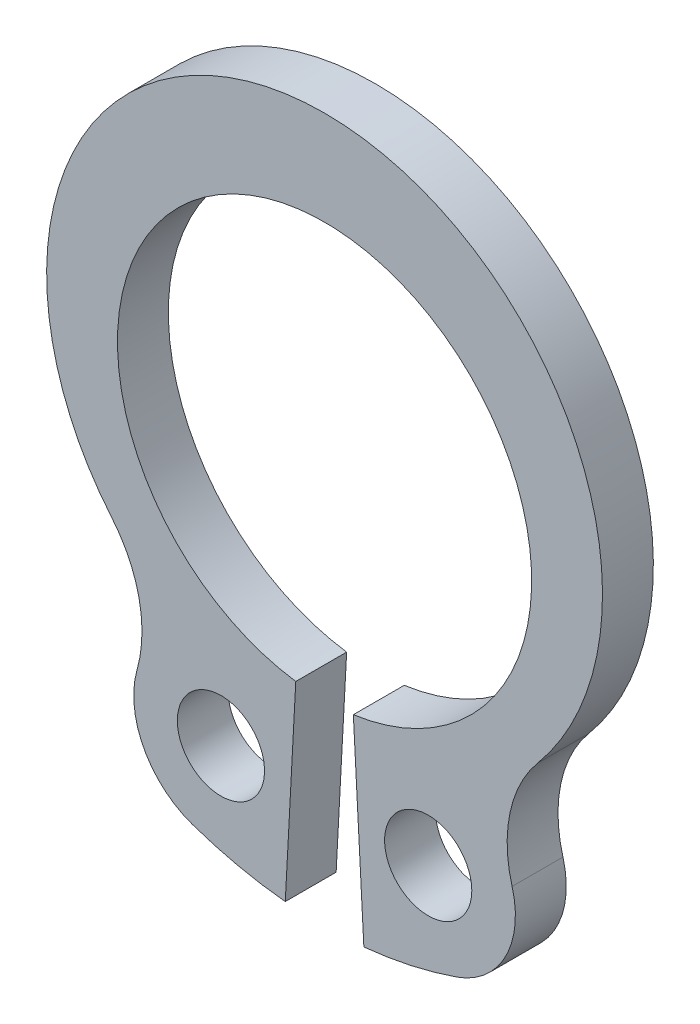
ISO-10303-21;
HEADER;
FILE_DESCRIPTION(('STEP AP214'),'2;1');
FILE_NAME('part.step','',(''),(''),'','','');
FILE_SCHEMA(('AUTOMOTIVE_DESIGN { 1 0 10303 214 1 1 1 1 }'));
ENDSEC;
DATA;
#1=APPLICATION_CONTEXT('core data for automotive mechanical design processes');
#2=APPLICATION_PROTOCOL_DEFINITION('international standard','automotive_design',2000,#1);
#3=PRODUCT_CONTEXT('',#1,'mechanical');
#4=PRODUCT('Part','Part','',(#3));
#5=PRODUCT_RELATED_PRODUCT_CATEGORY('part','',(#4));
#6=PRODUCT_DEFINITION_FORMATION('','',#4);
#7=PRODUCT_DEFINITION_CONTEXT('part definition',#1,'design');
#8=PRODUCT_DEFINITION('design','',#6,#7);
#9=PRODUCT_DEFINITION_SHAPE('','',#8);
#10=(LENGTH_UNIT() NAMED_UNIT(*) SI_UNIT(.MILLI.,.METRE.));
#11=(NAMED_UNIT(*) PLANE_ANGLE_UNIT() SI_UNIT($,.RADIAN.));
#12=(NAMED_UNIT(*) SI_UNIT($,.STERADIAN.) SOLID_ANGLE_UNIT());
#13=UNCERTAINTY_MEASURE_WITH_UNIT(LENGTH_MEASURE(1.E-05),#10,'distance_accuracy_value','');
#14=(GEOMETRIC_REPRESENTATION_CONTEXT(3) GLOBAL_UNCERTAINTY_ASSIGNED_CONTEXT((#13)) GLOBAL_UNIT_ASSIGNED_CONTEXT((#10,
#11,#12)) REPRESENTATION_CONTEXT('',''));
#15=CARTESIAN_POINT('',(0.,0.,0.));
#16=DIRECTION('',(0.,0.,1.));
#17=DIRECTION('',(1.,0.,0.));
#18=AXIS2_PLACEMENT_3D('',#15,#16,#17);
#19=CARTESIAN_POINT('',(0.,0.,0.7));
#20=DIRECTION('',(0.,0.,1.));
#21=DIRECTION('',(1.,0.,0.));
#22=AXIS2_PLACEMENT_3D('',#19,#20,#21);
#23=PLANE('',#22);
#24=CARTESIAN_POINT('',(-1.42625225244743,-4.10413419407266,0.7));
#25=DIRECTION('',(0.,0.,1.));
#26=DIRECTION('',(-1.,0.,0.));
#27=AXIS2_PLACEMENT_3D('',#24,#25,#26);
#28=CIRCLE('',#27,0.6);
#29=CARTESIAN_POINT('',(-2.02625225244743,-4.10413419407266,0.7));
#30=VERTEX_POINT('',#29);
#31=EDGE_CURVE('E120',#30,#30,#28,.T.);
#32=ORIENTED_EDGE('',*,*,#31,.F.);
#33=EDGE_LOOP('',(#32));
#34=FACE_BOUND('',#33,.T.);
#35=CARTESIAN_POINT('',(0.,0.,0.7));
#36=DIRECTION('',(0.,0.,-1.));
#37=DIRECTION('',(1.,0.,0.));
#38=AXIS2_PLACEMENT_3D('',#35,#36,#37);
#39=CIRCLE('',#38,2.85);
#40=CARTESIAN_POINT('',(-0.396088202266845,-2.82234195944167,0.7));
#41=VERTEX_POINT('',#40);
#42=CARTESIAN_POINT('',(0.396088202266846,-2.82234195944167,0.7));
#43=VERTEX_POINT('',#42);
#44=EDGE_CURVE('E142',#41,#43,#39,.T.);
#45=ORIENTED_EDGE('',*,*,#44,.T.);
#46=DIRECTION('',(0.0535843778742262,-0.998563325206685,0.));
#47=VECTOR('',#46,1.);
#48=CARTESIAN_POINT('',(0.396088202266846,-2.82234195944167,0.7));
#49=LINE('',#48,#47);
#50=CARTESIAN_POINT('',(0.540766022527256,-5.51846293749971,0.7));
#51=VERTEX_POINT('',#50);
#52=EDGE_CURVE('E115',#43,#51,#49,.T.);
#53=ORIENTED_EDGE('',*,*,#52,.T.);
#54=CARTESIAN_POINT('',(0.,0.,0.7));
#55=DIRECTION('',(0.,0.,1.));
#56=DIRECTION('',(1.,0.,0.));
#57=AXIS2_PLACEMENT_3D('',#54,#55,#56);
#58=CIRCLE('',#57,5.5448950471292);
#59=CARTESIAN_POINT('',(1.82016342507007,-5.23763937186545,0.7));
#60=VERTEX_POINT('',#59);
#61=EDGE_CURVE('E145',#51,#60,#58,.T.);
#62=ORIENTED_EDGE('',*,*,#61,.T.);
#63=CARTESIAN_POINT('',(1.42625225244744,-4.10413419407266,0.7));
#64=DIRECTION('',(0.,0.,1.));
#65=DIRECTION('',(1.,0.,0.));
#66=AXIS2_PLACEMENT_3D('',#63,#64,#65);
#67=CIRCLE('',#66,1.2);
#68=CARTESIAN_POINT('',(2.58080605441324,-3.77701721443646,0.7));
#69=VERTEX_POINT('',#68);
#70=EDGE_CURVE('E147',#60,#69,#67,.T.);
#71=ORIENTED_EDGE('',*,*,#70,.T.);
#72=CARTESIAN_POINT('',(4.31263675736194,-3.28634174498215,0.7));
#73=DIRECTION('',(0.,0.,-1.));
#74=DIRECTION('',(1.,0.,0.));
#75=AXIS2_PLACEMENT_3D('',#72,#73,#74);
#76=CIRCLE('',#75,1.8);
#77=CARTESIAN_POINT('',(2.93259299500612,-2.13071238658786,0.7));
#78=VERTEX_POINT('',#77);
#79=EDGE_CURVE('E149',#69,#78,#76,.T.);
#80=ORIENTED_EDGE('',*,*,#79,.T.);
#81=CARTESIAN_POINT('',(0.,0.325,0.7));
#82=DIRECTION('',(0.,0.,1.));
#83=DIRECTION('',(1.,0.,0.));
#84=AXIS2_PLACEMENT_3D('',#81,#82,#83);
#85=CIRCLE('',#84,3.825);
#86=CARTESIAN_POINT('',(-2.93259299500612,-2.13071238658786,0.7));
#87=VERTEX_POINT('',#86);
#88=EDGE_CURVE('E151',#78,#87,#85,.T.);
#89=ORIENTED_EDGE('',*,*,#88,.T.);
#90=CARTESIAN_POINT('',(-4.31263675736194,-3.28634174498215,0.7));
#91=DIRECTION('',(0.,0.,-1.));
#92=DIRECTION('',(-1.,0.,0.));
#93=AXIS2_PLACEMENT_3D('',#90,#91,#92);
#94=CIRCLE('',#93,1.8);
#95=CARTESIAN_POINT('',(-2.58080605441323,-3.77701721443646,0.7));
#96=VERTEX_POINT('',#95);
#97=EDGE_CURVE('E153',#87,#96,#94,.T.);
#98=ORIENTED_EDGE('',*,*,#97,.T.);
#99=CARTESIAN_POINT('',(-1.42625225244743,-4.10413419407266,0.7));
#100=DIRECTION('',(0.,0.,1.));
#101=DIRECTION('',(-1.,0.,0.));
#102=AXIS2_PLACEMENT_3D('',#99,#100,#101);
#103=CIRCLE('',#102,1.2);
#104=CARTESIAN_POINT('',(-1.82016342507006,-5.23763937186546,0.7));
#105=VERTEX_POINT('',#104);
#106=EDGE_CURVE('E155',#96,#105,#103,.T.);
#107=ORIENTED_EDGE('',*,*,#106,.T.);
#108=CARTESIAN_POINT('',(0.,0.,0.7));
#109=DIRECTION('',(0.,0.,1.));
#110=DIRECTION('',(-1.,0.,0.));
#111=AXIS2_PLACEMENT_3D('',#108,#109,#110);
#112=CIRCLE('',#111,5.5448950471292);
#113=CARTESIAN_POINT('',(-0.540766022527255,-5.51846293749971,0.7));
#114=VERTEX_POINT('',#113);
#115=EDGE_CURVE('E44',#105,#114,#112,.T.);
#116=ORIENTED_EDGE('',*,*,#115,.T.);
#117=DIRECTION('',(0.053584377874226,0.998563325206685,0.));
#118=VECTOR('',#117,1.);
#119=CARTESIAN_POINT('',(-0.396088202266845,-2.82234195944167,0.7));
#120=LINE('',#119,#118);
#121=EDGE_CURVE('E39',#114,#41,#120,.T.);
#122=ORIENTED_EDGE('',*,*,#121,.T.);
#123=EDGE_LOOP('',(#45,#53,#62,#71,#80,#89,#98,#107,#116,#122));
#124=FACE_BOUND('',#123,.T.);
#125=CARTESIAN_POINT('',(1.42625225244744,-4.10413419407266,0.7));
#126=DIRECTION('',(0.,0.,1.));
#127=DIRECTION('',(1.,0.,0.));
#128=AXIS2_PLACEMENT_3D('',#125,#126,#127);
#129=CIRCLE('',#128,0.6);
#130=CARTESIAN_POINT('',(2.02625225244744,-4.10413419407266,0.7));
#131=VERTEX_POINT('',#130);
#132=EDGE_CURVE('E242',#131,#131,#129,.T.);
#133=ORIENTED_EDGE('',*,*,#132,.F.);
#134=EDGE_LOOP('',(#133));
#135=FACE_BOUND('',#134,.T.);
#136=ADVANCED_FACE('F24',(#34,#124,#135),#23,.T.);
#137=CARTESIAN_POINT('',(0.,0.,0.));
#138=DIRECTION('',(0.,0.,1.));
#139=DIRECTION('',(1.,0.,0.));
#140=AXIS2_PLACEMENT_3D('',#137,#138,#139);
#141=PLANE('',#140);
#142=CARTESIAN_POINT('',(-1.42625225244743,-4.10413419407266,0.));
#143=DIRECTION('',(0.,0.,1.));
#144=DIRECTION('',(-1.,0.,0.));
#145=AXIS2_PLACEMENT_3D('',#142,#143,#144);
#146=CIRCLE('',#145,0.6);
#147=CARTESIAN_POINT('',(-2.02625225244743,-4.10413419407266,0.));
#148=VERTEX_POINT('',#147);
#149=EDGE_CURVE('E123',#148,#148,#146,.T.);
#150=ORIENTED_EDGE('',*,*,#149,.T.);
#151=EDGE_LOOP('',(#150));
#152=FACE_BOUND('',#151,.T.);
#153=CARTESIAN_POINT('',(0.,0.,0.));
#154=DIRECTION('',(0.,0.,-1.));
#155=DIRECTION('',(1.,0.,0.));
#156=AXIS2_PLACEMENT_3D('',#153,#154,#155);
#157=CIRCLE('',#156,2.85);
#158=CARTESIAN_POINT('',(-0.396088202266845,-2.82234195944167,0.));
#159=VERTEX_POINT('',#158);
#160=CARTESIAN_POINT('',(0.396088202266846,-2.82234195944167,0.));
#161=VERTEX_POINT('',#160);
#162=EDGE_CURVE('E106',#159,#161,#157,.T.);
#163=ORIENTED_EDGE('',*,*,#162,.F.);
#164=DIRECTION('',(0.053584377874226,0.998563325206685,0.));
#165=VECTOR('',#164,1.);
#166=CARTESIAN_POINT('',(-0.396088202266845,-2.82234195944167,0.));
#167=LINE('',#166,#165);
#168=CARTESIAN_POINT('',(-0.540766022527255,-5.51846293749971,0.));
#169=VERTEX_POINT('',#168);
#170=EDGE_CURVE('E140',#169,#159,#167,.T.);
#171=ORIENTED_EDGE('',*,*,#170,.F.);
#172=CARTESIAN_POINT('',(0.,0.,0.));
#173=DIRECTION('',(0.,0.,1.));
#174=DIRECTION('',(-1.,0.,0.));
#175=AXIS2_PLACEMENT_3D('',#172,#173,#174);
#176=CIRCLE('',#175,5.5448950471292);
#177=CARTESIAN_POINT('',(-1.82016342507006,-5.23763937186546,0.));
#178=VERTEX_POINT('',#177);
#179=EDGE_CURVE('E138',#178,#169,#176,.T.);
#180=ORIENTED_EDGE('',*,*,#179,.F.);
#181=CARTESIAN_POINT('',(-1.42625225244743,-4.10413419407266,0.));
#182=DIRECTION('',(0.,0.,1.));
#183=DIRECTION('',(-1.,0.,0.));
#184=AXIS2_PLACEMENT_3D('',#181,#182,#183);
#185=CIRCLE('',#184,1.2);
#186=CARTESIAN_POINT('',(-2.58080605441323,-3.77701721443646,0.));
#187=VERTEX_POINT('',#186);
#188=EDGE_CURVE('E136',#187,#178,#185,.T.);
#189=ORIENTED_EDGE('',*,*,#188,.F.);
#190=CARTESIAN_POINT('',(-4.31263675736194,-3.28634174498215,0.));
#191=DIRECTION('',(0.,0.,-1.));
#192=DIRECTION('',(-1.,0.,0.));
#193=AXIS2_PLACEMENT_3D('',#190,#191,#192);
#194=CIRCLE('',#193,1.8);
#195=CARTESIAN_POINT('',(-2.93259299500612,-2.13071238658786,0.));
#196=VERTEX_POINT('',#195);
#197=EDGE_CURVE('E134',#196,#187,#194,.T.);
#198=ORIENTED_EDGE('',*,*,#197,.F.);
#199=CARTESIAN_POINT('',(0.,0.325,0.));
#200=DIRECTION('',(0.,0.,1.));
#201=DIRECTION('',(1.,0.,0.));
#202=AXIS2_PLACEMENT_3D('',#199,#200,#201);
#203=CIRCLE('',#202,3.825);
#204=CARTESIAN_POINT('',(2.93259299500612,-2.13071238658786,0.));
#205=VERTEX_POINT('',#204);
#206=EDGE_CURVE('E132',#205,#196,#203,.T.);
#207=ORIENTED_EDGE('',*,*,#206,.F.);
#208=CARTESIAN_POINT('',(4.31263675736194,-3.28634174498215,0.));
#209=DIRECTION('',(0.,0.,-1.));
#210=DIRECTION('',(1.,0.,0.));
#211=AXIS2_PLACEMENT_3D('',#208,#209,#210);
#212=CIRCLE('',#211,1.8);
#213=CARTESIAN_POINT('',(2.58080605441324,-3.77701721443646,0.));
#214=VERTEX_POINT('',#213);
#215=EDGE_CURVE('E130',#214,#205,#212,.T.);
#216=ORIENTED_EDGE('',*,*,#215,.F.);
#217=CARTESIAN_POINT('',(1.42625225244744,-4.10413419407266,0.));
#218=DIRECTION('',(0.,0.,1.));
#219=DIRECTION('',(1.,0.,0.));
#220=AXIS2_PLACEMENT_3D('',#217,#218,#219);
#221=CIRCLE('',#220,1.2);
#222=CARTESIAN_POINT('',(1.82016342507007,-5.23763937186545,0.));
#223=VERTEX_POINT('',#222);
#224=EDGE_CURVE('E128',#223,#214,#221,.T.);
#225=ORIENTED_EDGE('',*,*,#224,.F.);
#226=CARTESIAN_POINT('',(0.,0.,0.));
#227=DIRECTION('',(0.,0.,1.));
#228=DIRECTION('',(1.,0.,0.));
#229=AXIS2_PLACEMENT_3D('',#226,#227,#228);
#230=CIRCLE('',#229,5.5448950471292);
#231=CARTESIAN_POINT('',(0.540766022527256,-5.51846293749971,0.));
#232=VERTEX_POINT('',#231);
#233=EDGE_CURVE('E108',#232,#223,#230,.T.);
#234=ORIENTED_EDGE('',*,*,#233,.F.);
#235=DIRECTION('',(0.0535843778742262,-0.998563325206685,0.));
#236=VECTOR('',#235,1.);
#237=CARTESIAN_POINT('',(0.396088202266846,-2.82234195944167,0.));
#238=LINE('',#237,#236);
#239=EDGE_CURVE('E101',#161,#232,#238,.T.);
#240=ORIENTED_EDGE('',*,*,#239,.F.);
#241=EDGE_LOOP('',(#163,#171,#180,#189,#198,#207,#216,#225,#234,#240));
#242=FACE_BOUND('',#241,.T.);
#243=CARTESIAN_POINT('',(1.42625225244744,-4.10413419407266,0.));
#244=DIRECTION('',(0.,0.,1.));
#245=DIRECTION('',(1.,0.,0.));
#246=AXIS2_PLACEMENT_3D('',#243,#244,#245);
#247=CIRCLE('',#246,0.6);
#248=CARTESIAN_POINT('',(2.02625225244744,-4.10413419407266,0.));
#249=VERTEX_POINT('',#248);
#250=EDGE_CURVE('E245',#249,#249,#247,.T.);
#251=ORIENTED_EDGE('',*,*,#250,.T.);
#252=EDGE_LOOP('',(#251));
#253=FACE_BOUND('',#252,.T.);
#254=ADVANCED_FACE('F102',(#152,#242,#253),#141,.F.);
#255=CARTESIAN_POINT('',(0.,0.,0.7));
#256=DIRECTION('',(0.,0.,-1.));
#257=DIRECTION('',(-1.,0.,0.));
#258=AXIS2_PLACEMENT_3D('',#255,#256,#257);
#259=CYLINDRICAL_SURFACE('',#258,2.85);
#260=ORIENTED_EDGE('',*,*,#162,.T.);
#261=DIRECTION('',(0.,0.,-1.));
#262=VECTOR('',#261,1.);
#263=CARTESIAN_POINT('',(0.396088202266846,-2.82234195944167,0.7));
#264=LINE('',#263,#262);
#265=EDGE_CURVE('E11',#43,#161,#264,.T.);
#266=ORIENTED_EDGE('',*,*,#265,.F.);
#267=ORIENTED_EDGE('',*,*,#44,.F.);
#268=DIRECTION('',(0.,0.,-1.));
#269=VECTOR('',#268,1.);
#270=CARTESIAN_POINT('',(-0.396088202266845,-2.82234195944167,0.7));
#271=LINE('',#270,#269);
#272=EDGE_CURVE('E119',#41,#159,#271,.T.);
#273=ORIENTED_EDGE('',*,*,#272,.T.);
#274=EDGE_LOOP('',(#260,#266,#267,#273));
#275=FACE_BOUND('',#274,.T.);
#276=ADVANCED_FACE('F26',(#275),#259,.F.);
#277=CARTESIAN_POINT('',(0.396088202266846,-2.82234195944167,0.7));
#278=DIRECTION('',(0.998563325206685,0.0535843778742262,0.));
#279=DIRECTION('',(-0.0535843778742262,0.998563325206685,0.));
#280=AXIS2_PLACEMENT_3D('',#277,#278,#279);
#281=PLANE('',#280);
#282=ORIENTED_EDGE('',*,*,#239,.T.);
#283=DIRECTION('',(0.,0.,-1.));
#284=VECTOR('',#283,1.);
#285=CARTESIAN_POINT('',(0.540766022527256,-5.51846293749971,0.7));
#286=LINE('',#285,#284);
#287=EDGE_CURVE('E32',#51,#232,#286,.T.);
#288=ORIENTED_EDGE('',*,*,#287,.F.);
#289=ORIENTED_EDGE('',*,*,#52,.F.);
#290=ORIENTED_EDGE('',*,*,#265,.T.);
#291=EDGE_LOOP('',(#282,#288,#289,#290));
#292=FACE_BOUND('',#291,.T.);
#293=ADVANCED_FACE('F114',(#292),#281,.F.);
#294=CARTESIAN_POINT('',(0.,0.,0.7));
#295=DIRECTION('',(0.,0.,-1.));
#296=DIRECTION('',(-1.,0.,0.));
#297=AXIS2_PLACEMENT_3D('',#294,#295,#296);
#298=CYLINDRICAL_SURFACE('',#297,5.5448950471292);
#299=ORIENTED_EDGE('',*,*,#233,.T.);
#300=DIRECTION('',(0.,0.,-1.));
#301=VECTOR('',#300,1.);
#302=CARTESIAN_POINT('',(1.82016342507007,-5.23763937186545,0.7));
#303=LINE('',#302,#301);
#304=EDGE_CURVE('E178',#60,#223,#303,.T.);
#305=ORIENTED_EDGE('',*,*,#304,.F.);
#306=ORIENTED_EDGE('',*,*,#61,.F.);
#307=ORIENTED_EDGE('',*,*,#287,.T.);
#308=EDGE_LOOP('',(#299,#305,#306,#307));
#309=FACE_BOUND('',#308,.T.);
#310=ADVANCED_FACE('F182',(#309),#298,.T.);
#311=CARTESIAN_POINT('',(1.42625225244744,-4.10413419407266,0.7));
#312=DIRECTION('',(0.,0.,-1.));
#313=DIRECTION('',(-1.,0.,0.));
#314=AXIS2_PLACEMENT_3D('',#311,#312,#313);
#315=CYLINDRICAL_SURFACE('',#314,1.2);
#316=ORIENTED_EDGE('',*,*,#224,.T.);
#317=DIRECTION('',(0.,0.,-1.));
#318=VECTOR('',#317,1.);
#319=CARTESIAN_POINT('',(2.58080605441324,-3.77701721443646,0.7));
#320=LINE('',#319,#318);
#321=EDGE_CURVE('E175',#69,#214,#320,.T.);
#322=ORIENTED_EDGE('',*,*,#321,.F.);
#323=ORIENTED_EDGE('',*,*,#70,.F.);
#324=ORIENTED_EDGE('',*,*,#304,.T.);
#325=EDGE_LOOP('',(#316,#322,#323,#324));
#326=FACE_BOUND('',#325,.T.);
#327=ADVANCED_FACE('F190',(#326),#315,.T.);
#328=CARTESIAN_POINT('',(4.31263675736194,-3.28634174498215,0.7));
#329=DIRECTION('',(0.,0.,-1.));
#330=DIRECTION('',(-1.,0.,0.));
#331=AXIS2_PLACEMENT_3D('',#328,#329,#330);
#332=CYLINDRICAL_SURFACE('',#331,1.8);
#333=ORIENTED_EDGE('',*,*,#215,.T.);
#334=DIRECTION('',(0.,0.,-1.));
#335=VECTOR('',#334,1.);
#336=CARTESIAN_POINT('',(2.93259299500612,-2.13071238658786,0.7));
#337=LINE('',#336,#335);
#338=EDGE_CURVE('E172',#78,#205,#337,.T.);
#339=ORIENTED_EDGE('',*,*,#338,.F.);
#340=ORIENTED_EDGE('',*,*,#79,.F.);
#341=ORIENTED_EDGE('',*,*,#321,.T.);
#342=EDGE_LOOP('',(#333,#339,#340,#341));
#343=FACE_BOUND('',#342,.T.);
#344=ADVANCED_FACE('F193',(#343),#332,.F.);
#345=CARTESIAN_POINT('',(0.,0.325,0.7));
#346=DIRECTION('',(0.,0.,-1.));
#347=DIRECTION('',(-1.,0.,0.));
#348=AXIS2_PLACEMENT_3D('',#345,#346,#347);
#349=CYLINDRICAL_SURFACE('',#348,3.825);
#350=ORIENTED_EDGE('',*,*,#206,.T.);
#351=DIRECTION('',(0.,0.,-1.));
#352=VECTOR('',#351,1.);
#353=CARTESIAN_POINT('',(-2.93259299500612,-2.13071238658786,0.7));
#354=LINE('',#353,#352);
#355=EDGE_CURVE('E169',#87,#196,#354,.T.);
#356=ORIENTED_EDGE('',*,*,#355,.F.);
#357=ORIENTED_EDGE('',*,*,#88,.F.);
#358=ORIENTED_EDGE('',*,*,#338,.T.);
#359=EDGE_LOOP('',(#350,#356,#357,#358));
#360=FACE_BOUND('',#359,.T.);
#361=ADVANCED_FACE('F198',(#360),#349,.T.);
#362=CARTESIAN_POINT('',(-4.31263675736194,-3.28634174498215,0.7));
#363=DIRECTION('',(0.,0.,-1.));
#364=DIRECTION('',(-1.,0.,0.));
#365=AXIS2_PLACEMENT_3D('',#362,#363,#364);
#366=CYLINDRICAL_SURFACE('',#365,1.8);
#367=ORIENTED_EDGE('',*,*,#197,.T.);
#368=DIRECTION('',(0.,0.,-1.));
#369=VECTOR('',#368,1.);
#370=CARTESIAN_POINT('',(-2.58080605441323,-3.77701721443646,0.7));
#371=LINE('',#370,#369);
#372=EDGE_CURVE('E166',#96,#187,#371,.T.);
#373=ORIENTED_EDGE('',*,*,#372,.F.);
#374=ORIENTED_EDGE('',*,*,#97,.F.);
#375=ORIENTED_EDGE('',*,*,#355,.T.);
#376=EDGE_LOOP('',(#367,#373,#374,#375));
#377=FACE_BOUND('',#376,.T.);
#378=ADVANCED_FACE('F204',(#377),#366,.F.);
#379=CARTESIAN_POINT('',(-1.42625225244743,-4.10413419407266,0.7));
#380=DIRECTION('',(0.,0.,-1.));
#381=DIRECTION('',(-1.,0.,0.));
#382=AXIS2_PLACEMENT_3D('',#379,#380,#381);
#383=CYLINDRICAL_SURFACE('',#382,1.2);
#384=ORIENTED_EDGE('',*,*,#188,.T.);
#385=DIRECTION('',(0.,0.,-1.));
#386=VECTOR('',#385,1.);
#387=CARTESIAN_POINT('',(-1.82016342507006,-5.23763937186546,0.7));
#388=LINE('',#387,#386);
#389=EDGE_CURVE('E163',#105,#178,#388,.T.);
#390=ORIENTED_EDGE('',*,*,#389,.F.);
#391=ORIENTED_EDGE('',*,*,#106,.F.);
#392=ORIENTED_EDGE('',*,*,#372,.T.);
#393=EDGE_LOOP('',(#384,#390,#391,#392));
#394=FACE_BOUND('',#393,.T.);
#395=ADVANCED_FACE('F208',(#394),#383,.T.);
#396=CARTESIAN_POINT('',(0.,0.,0.7));
#397=DIRECTION('',(0.,0.,-1.));
#398=DIRECTION('',(-1.,0.,0.));
#399=AXIS2_PLACEMENT_3D('',#396,#397,#398);
#400=CYLINDRICAL_SURFACE('',#399,5.5448950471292);
#401=ORIENTED_EDGE('',*,*,#179,.T.);
#402=DIRECTION('',(0.,0.,-1.));
#403=VECTOR('',#402,1.);
#404=CARTESIAN_POINT('',(-0.540766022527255,-5.51846293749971,0.7));
#405=LINE('',#404,#403);
#406=EDGE_CURVE('E160',#114,#169,#405,.T.);
#407=ORIENTED_EDGE('',*,*,#406,.F.);
#408=ORIENTED_EDGE('',*,*,#115,.F.);
#409=ORIENTED_EDGE('',*,*,#389,.T.);
#410=EDGE_LOOP('',(#401,#407,#408,#409));
#411=FACE_BOUND('',#410,.T.);
#412=ADVANCED_FACE('F211',(#411),#400,.T.);
#413=CARTESIAN_POINT('',(-0.396088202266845,-2.82234195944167,0.7));
#414=DIRECTION('',(-0.998563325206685,0.053584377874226,0.));
#415=DIRECTION('',(-0.053584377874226,-0.998563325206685,0.));
#416=AXIS2_PLACEMENT_3D('',#413,#414,#415);
#417=PLANE('',#416);
#418=ORIENTED_EDGE('',*,*,#170,.T.);
#419=ORIENTED_EDGE('',*,*,#272,.F.);
#420=ORIENTED_EDGE('',*,*,#121,.F.);
#421=ORIENTED_EDGE('',*,*,#406,.T.);
#422=EDGE_LOOP('',(#418,#419,#420,#421));
#423=FACE_BOUND('',#422,.T.);
#424=ADVANCED_FACE('F213',(#423),#417,.F.);
#425=CARTESIAN_POINT('',(-1.42625225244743,-4.10413419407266,0.7));
#426=DIRECTION('',(0.,0.,-1.));
#427=DIRECTION('',(-1.,0.,0.));
#428=AXIS2_PLACEMENT_3D('',#425,#426,#427);
#429=CYLINDRICAL_SURFACE('',#428,0.6);
#430=ORIENTED_EDGE('',*,*,#31,.T.);
#431=EDGE_LOOP('',(#430));
#432=FACE_BOUND('',#431,.T.);
#433=ORIENTED_EDGE('',*,*,#149,.F.);
#434=EDGE_LOOP('',(#433));
#435=FACE_BOUND('',#434,.T.);
#436=ADVANCED_FACE('F215',(#432,#435),#429,.F.);
#437=CARTESIAN_POINT('',(1.42625225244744,-4.10413419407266,0.7));
#438=DIRECTION('',(0.,0.,-1.));
#439=DIRECTION('',(-1.,0.,0.));
#440=AXIS2_PLACEMENT_3D('',#437,#438,#439);
#441=CYLINDRICAL_SURFACE('',#440,0.6);
#442=ORIENTED_EDGE('',*,*,#132,.T.);
#443=EDGE_LOOP('',(#442));
#444=FACE_BOUND('',#443,.T.);
#445=ORIENTED_EDGE('',*,*,#250,.F.);
#446=EDGE_LOOP('',(#445));
#447=FACE_BOUND('',#446,.T.);
#448=ADVANCED_FACE('F221',(#444,#447),#441,.F.);
#449=CLOSED_SHELL('',(#136,#254,#276,#293,#310,#327,#344,#361,#378,#395,#412,#424,#436,#448));
#450=MANIFOLD_SOLID_BREP('B2',#449);
#451=ADVANCED_BREP_SHAPE_REPRESENTATION('',(#18,#450),#14);
#452=SHAPE_DEFINITION_REPRESENTATION(#9,#451);
ENDSEC;
END-ISO-10303-21;
